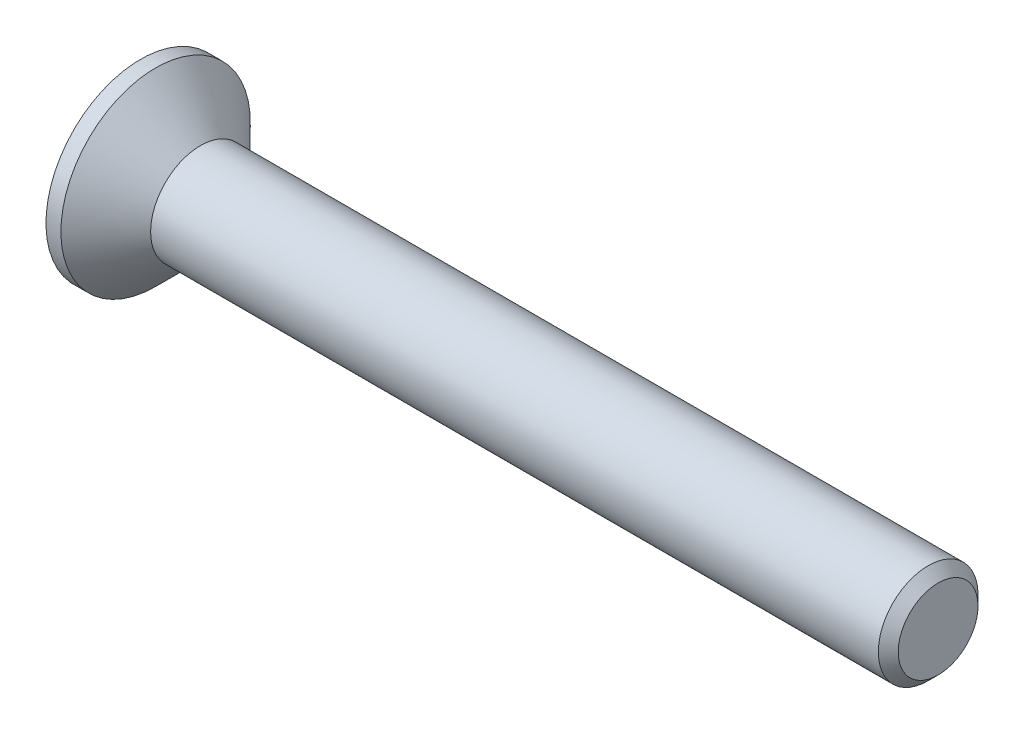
from build123d import *

# Parameters (mm, degrees)
CHAMFER1_SIZE      = 0.2
CUT_EXTRUDE1_DEPTH = 0.95


with BuildPart() as part:
    # Sketch1 → Revolve1 (revolve)
    with BuildSketch(Plane.XY, mode=Mode.PRIVATE) as revolve1_sk:
        Polygon((-1.2, 1.9), (-1.2, 0), (14.8, 0), (14.8, 1), (0, 1), (-0.9, 1.9), align=None)
    revolve(revolve1_sk.sketch.rotate(Axis((-1.2, 0, 0), (1, 0, 0)), 180), axis=Axis((-1.2, 0, 0), (1, 0, 0)))

    # Chamfer1
    chamfer1_edges = [part.edges().sort_by_distance(p)[0] for p in [
        (14.8, 1, 0),
    ]]
    chamfer(chamfer1_edges, length=CHAMFER1_SIZE)

    # Sketch2 → Cut-Extrude1 (cut)
    with BuildSketch(Plane.ZY.offset(1.2)):
        Polygon((-0.3, 1.175), (0.3, 1.175), (0.3, 0.3), (1.175, 0.3), (1.175, -0.3), (0.3, -0.3), (0.3, -1.175), (-0.3, -1.175), (-0.3, -0.3), (-1.175, -0.3), (-1.175, 0.3), (-0.3, 0.3), align=None)
    extrude(amount=-CUT_EXTRUDE1_DEPTH, mode=Mode.SUBTRACT)


solid = part.part
